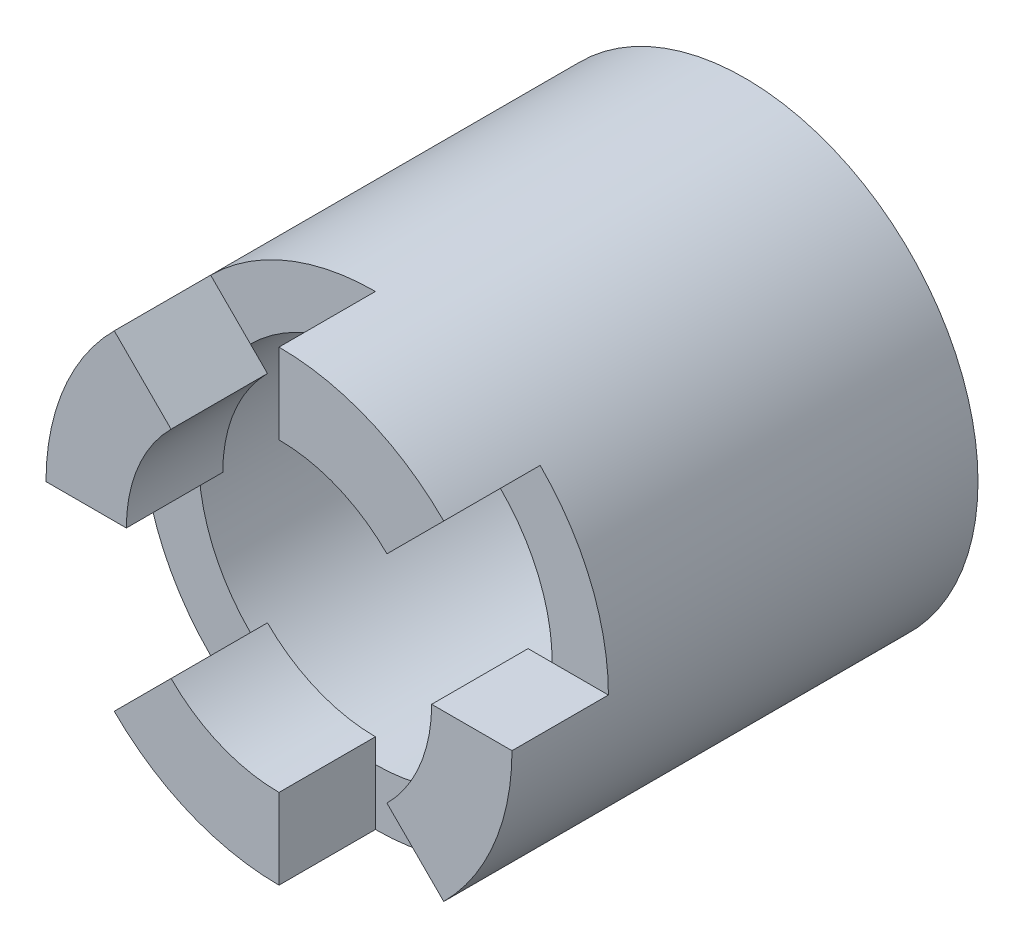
ISO-10303-21;
HEADER;
FILE_DESCRIPTION(('STEP AP214'),'2;1');
FILE_NAME('part.step','',(''),(''),'','','');
FILE_SCHEMA(('AUTOMOTIVE_DESIGN { 1 0 10303 214 1 1 1 1 }'));
ENDSEC;
DATA;
#1=APPLICATION_CONTEXT('core data for automotive mechanical design processes');
#2=APPLICATION_PROTOCOL_DEFINITION('international standard','automotive_design',2000,#1);
#3=PRODUCT_CONTEXT('',#1,'mechanical');
#4=PRODUCT('Part','Part','',(#3));
#5=PRODUCT_RELATED_PRODUCT_CATEGORY('part','',(#4));
#6=PRODUCT_DEFINITION_FORMATION('','',#4);
#7=PRODUCT_DEFINITION_CONTEXT('part definition',#1,'design');
#8=PRODUCT_DEFINITION('design','',#6,#7);
#9=PRODUCT_DEFINITION_SHAPE('','',#8);
#10=(LENGTH_UNIT() NAMED_UNIT(*) SI_UNIT(.MILLI.,.METRE.));
#11=(NAMED_UNIT(*) PLANE_ANGLE_UNIT() SI_UNIT($,.RADIAN.));
#12=(NAMED_UNIT(*) SI_UNIT($,.STERADIAN.) SOLID_ANGLE_UNIT());
#13=UNCERTAINTY_MEASURE_WITH_UNIT(LENGTH_MEASURE(1.E-05),#10,'distance_accuracy_value','');
#14=(GEOMETRIC_REPRESENTATION_CONTEXT(3) GLOBAL_UNCERTAINTY_ASSIGNED_CONTEXT((#13)) GLOBAL_UNIT_ASSIGNED_CONTEXT((#10,
#11,#12)) REPRESENTATION_CONTEXT('',''));
#15=CARTESIAN_POINT('',(0.,0.,0.));
#16=DIRECTION('',(0.,0.,1.));
#17=DIRECTION('',(1.,0.,0.));
#18=AXIS2_PLACEMENT_3D('',#15,#16,#17);
#19=CARTESIAN_POINT('',(0.,0.,11.5));
#20=DIRECTION('',(0.,0.,1.));
#21=DIRECTION('',(1.,0.,0.));
#22=AXIS2_PLACEMENT_3D('',#19,#20,#21);
#23=PLANE('',#22);
#24=CARTESIAN_POINT('',(0.,0.,11.5));
#25=DIRECTION('',(0.,0.,1.));
#26=DIRECTION('',(1.,0.,0.));
#27=AXIS2_PLACEMENT_3D('',#24,#25,#26);
#28=CIRCLE('',#27,5.5);
#29=CARTESIAN_POINT('',(5.5,0.,11.5));
#30=VERTEX_POINT('',#29);
#31=CARTESIAN_POINT('',(3.889087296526,3.88908729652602,11.5));
#32=VERTEX_POINT('',#31);
#33=EDGE_CURVE('E331',#30,#32,#28,.T.);
#34=ORIENTED_EDGE('',*,*,#33,.F.);
#35=DIRECTION('',(-1.,0.,0.));
#36=VECTOR('',#35,1.);
#37=CARTESIAN_POINT('',(4.75,0.,11.5));
#38=LINE('',#37,#36);
#39=CARTESIAN_POINT('',(7.25,0.,11.5));
#40=VERTEX_POINT('',#39);
#41=EDGE_CURVE('E58',#40,#30,#38,.T.);
#42=ORIENTED_EDGE('',*,*,#41,.F.);
#43=CARTESIAN_POINT('',(0.,0.,11.5));
#44=DIRECTION('',(0.,0.,1.));
#45=DIRECTION('',(1.,0.,0.));
#46=AXIS2_PLACEMENT_3D('',#43,#44,#45);
#47=CIRCLE('',#46,7.25);
#48=CARTESIAN_POINT('',(5.12652416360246,5.12652416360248,11.5));
#49=VERTEX_POINT('',#48);
#50=EDGE_CURVE('E205',#40,#49,#47,.T.);
#51=ORIENTED_EDGE('',*,*,#50,.T.);
#52=DIRECTION('',(0.707106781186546,0.707106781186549,0.));
#53=VECTOR('',#52,1.);
#54=CARTESIAN_POINT('',(3.35875721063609,3.35875721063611,11.5));
#55=LINE('',#54,#53);
#56=EDGE_CURVE('E11',#32,#49,#55,.T.);
#57=ORIENTED_EDGE('',*,*,#56,.F.);
#58=EDGE_LOOP('',(#34,#42,#51,#57));
#59=FACE_BOUND('',#58,.T.);
#60=ADVANCED_FACE('F39',(#59),#23,.T.);
#61=CARTESIAN_POINT('',(0.,-7.25,11.5));
#62=VERTEX_POINT('',#61);
#63=CARTESIAN_POINT('',(5.12652416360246,-5.12652416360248,11.5));
#64=VERTEX_POINT('',#63);
#65=EDGE_CURVE('E342',#62,#64,#47,.T.);
#66=ORIENTED_EDGE('',*,*,#65,.T.);
#67=DIRECTION('',(0.707106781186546,-0.707106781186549,0.));
#68=VECTOR('',#67,1.);
#69=CARTESIAN_POINT('',(3.3587572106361,-3.35875721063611,11.5));
#70=LINE('',#69,#68);
#71=CARTESIAN_POINT('',(3.889087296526,-3.88908729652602,11.5));
#72=VERTEX_POINT('',#71);
#73=EDGE_CURVE('E355',#72,#64,#70,.T.);
#74=ORIENTED_EDGE('',*,*,#73,.F.);
#75=CARTESIAN_POINT('',(0.,-5.5,11.5));
#76=VERTEX_POINT('',#75);
#77=EDGE_CURVE('E431',#76,#72,#28,.T.);
#78=ORIENTED_EDGE('',*,*,#77,.F.);
#79=DIRECTION('',(0.,1.,0.));
#80=VECTOR('',#79,1.);
#81=CARTESIAN_POINT('',(0.,-4.75,11.5));
#82=LINE('',#81,#80);
#83=EDGE_CURVE('E269',#62,#76,#82,.T.);
#84=ORIENTED_EDGE('',*,*,#83,.F.);
#85=EDGE_LOOP('',(#66,#74,#78,#84));
#86=FACE_BOUND('',#85,.T.);
#87=ADVANCED_FACE('F353',(#86),#23,.T.);
#88=CARTESIAN_POINT('',(-5.5,0.,11.5));
#89=VERTEX_POINT('',#88);
#90=CARTESIAN_POINT('',(-3.889087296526,-3.88908729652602,11.5));
#91=VERTEX_POINT('',#90);
#92=EDGE_CURVE('E414',#89,#91,#28,.T.);
#93=ORIENTED_EDGE('',*,*,#92,.F.);
#94=DIRECTION('',(1.,0.,0.));
#95=VECTOR('',#94,1.);
#96=CARTESIAN_POINT('',(-7.25,0.,11.5));
#97=LINE('',#96,#95);
#98=CARTESIAN_POINT('',(-7.25,0.,11.5));
#99=VERTEX_POINT('',#98);
#100=EDGE_CURVE('E66',#99,#89,#97,.T.);
#101=ORIENTED_EDGE('',*,*,#100,.F.);
#102=CARTESIAN_POINT('',(-5.12652416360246,-5.12652416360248,11.5));
#103=VERTEX_POINT('',#102);
#104=EDGE_CURVE('E341',#99,#103,#47,.T.);
#105=ORIENTED_EDGE('',*,*,#104,.T.);
#106=DIRECTION('',(-0.707106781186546,-0.707106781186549,0.));
#107=VECTOR('',#106,1.);
#108=CARTESIAN_POINT('',(-5.12652416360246,-5.12652416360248,11.5));
#109=LINE('',#108,#107);
#110=EDGE_CURVE('E275',#91,#103,#109,.T.);
#111=ORIENTED_EDGE('',*,*,#110,.F.);
#112=EDGE_LOOP('',(#93,#101,#105,#111));
#113=FACE_BOUND('',#112,.T.);
#114=ADVANCED_FACE('F400',(#113),#23,.T.);
#115=CARTESIAN_POINT('',(0.,7.25,11.5));
#116=VERTEX_POINT('',#115);
#117=CARTESIAN_POINT('',(-5.12652416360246,5.12652416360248,11.5));
#118=VERTEX_POINT('',#117);
#119=EDGE_CURVE('E49',#116,#118,#47,.T.);
#120=ORIENTED_EDGE('',*,*,#119,.T.);
#121=DIRECTION('',(-0.707106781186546,0.707106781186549,0.));
#122=VECTOR('',#121,1.);
#123=CARTESIAN_POINT('',(-5.12652416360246,5.12652416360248,11.5));
#124=LINE('',#123,#122);
#125=CARTESIAN_POINT('',(-3.88908729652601,3.88908729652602,11.5));
#126=VERTEX_POINT('',#125);
#127=EDGE_CURVE('E235',#126,#118,#124,.T.);
#128=ORIENTED_EDGE('',*,*,#127,.F.);
#129=CARTESIAN_POINT('',(0.,5.5,11.5));
#130=VERTEX_POINT('',#129);
#131=EDGE_CURVE('E338',#130,#126,#28,.T.);
#132=ORIENTED_EDGE('',*,*,#131,.F.);
#133=DIRECTION('',(0.,-1.,0.));
#134=VECTOR('',#133,1.);
#135=CARTESIAN_POINT('',(0.,7.25,11.5));
#136=LINE('',#135,#134);
#137=EDGE_CURVE('E308',#116,#130,#136,.T.);
#138=ORIENTED_EDGE('',*,*,#137,.F.);
#139=EDGE_LOOP('',(#120,#128,#132,#138));
#140=FACE_BOUND('',#139,.T.);
#141=ADVANCED_FACE('F396',(#140),#23,.T.);
#142=CARTESIAN_POINT('',(0.,0.,11.5));
#143=DIRECTION('',(0.,0.,-1.));
#144=DIRECTION('',(-1.,0.,0.));
#145=AXIS2_PLACEMENT_3D('',#142,#143,#144);
#146=CYLINDRICAL_SURFACE('',#145,7.25);
#147=ORIENTED_EDGE('',*,*,#119,.F.);
#148=DIRECTION('',(0.,0.,-1.));
#149=VECTOR('',#148,1.);
#150=CARTESIAN_POINT('',(0.,7.25,14.5));
#151=LINE('',#150,#149);
#152=CARTESIAN_POINT('',(0.,7.25,14.5));
#153=VERTEX_POINT('',#152);
#154=EDGE_CURVE('E327',#153,#116,#151,.T.);
#155=ORIENTED_EDGE('',*,*,#154,.F.);
#156=CARTESIAN_POINT('',(0.,0.,14.5));
#157=DIRECTION('',(0.,0.,1.));
#158=DIRECTION('',(1.,0.,0.));
#159=AXIS2_PLACEMENT_3D('',#156,#157,#158);
#160=CIRCLE('',#159,7.25);
#161=CARTESIAN_POINT('',(5.12652416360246,5.12652416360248,14.5));
#162=VERTEX_POINT('',#161);
#163=EDGE_CURVE('E294',#162,#153,#160,.T.);
#164=ORIENTED_EDGE('',*,*,#163,.F.);
#165=DIRECTION('',(0.,0.,-1.));
#166=VECTOR('',#165,1.);
#167=CARTESIAN_POINT('',(5.12652416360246,5.12652416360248,14.5));
#168=LINE('',#167,#166);
#169=EDGE_CURVE('E307',#162,#49,#168,.T.);
#170=ORIENTED_EDGE('',*,*,#169,.T.);
#171=ORIENTED_EDGE('',*,*,#50,.F.);
#172=DIRECTION('',(0.,0.,-1.));
#173=VECTOR('',#172,1.);
#174=CARTESIAN_POINT('',(7.25,0.,14.5));
#175=LINE('',#174,#173);
#176=CARTESIAN_POINT('',(7.25,0.,14.5));
#177=VERTEX_POINT('',#176);
#178=EDGE_CURVE('E182',#177,#40,#175,.T.);
#179=ORIENTED_EDGE('',*,*,#178,.F.);
#180=CARTESIAN_POINT('',(0.,0.,14.5));
#181=DIRECTION('',(0.,0.,1.));
#182=DIRECTION('',(1.,0.,0.));
#183=AXIS2_PLACEMENT_3D('',#180,#181,#182);
#184=CIRCLE('',#183,7.25);
#185=CARTESIAN_POINT('',(5.12652416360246,-5.12652416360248,14.5));
#186=VERTEX_POINT('',#185);
#187=EDGE_CURVE('E189',#186,#177,#184,.T.);
#188=ORIENTED_EDGE('',*,*,#187,.F.);
#189=DIRECTION('',(0.,0.,-1.));
#190=VECTOR('',#189,1.);
#191=CARTESIAN_POINT('',(5.12652416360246,-5.12652416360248,14.5));
#192=LINE('',#191,#190);
#193=EDGE_CURVE('E359',#186,#64,#192,.T.);
#194=ORIENTED_EDGE('',*,*,#193,.T.);
#195=ORIENTED_EDGE('',*,*,#65,.F.);
#196=DIRECTION('',(0.,0.,-1.));
#197=VECTOR('',#196,1.);
#198=CARTESIAN_POINT('',(0.,-7.25,14.5));
#199=LINE('',#198,#197);
#200=CARTESIAN_POINT('',(0.,-7.25,14.5));
#201=VERTEX_POINT('',#200);
#202=EDGE_CURVE('E290',#201,#62,#199,.T.);
#203=ORIENTED_EDGE('',*,*,#202,.F.);
#204=CARTESIAN_POINT('',(0.,0.,14.5));
#205=DIRECTION('',(0.,0.,1.));
#206=DIRECTION('',(1.,0.,0.));
#207=AXIS2_PLACEMENT_3D('',#204,#205,#206);
#208=CIRCLE('',#207,7.25);
#209=CARTESIAN_POINT('',(-5.12652416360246,-5.12652416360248,14.5));
#210=VERTEX_POINT('',#209);
#211=EDGE_CURVE('E254',#210,#201,#208,.T.);
#212=ORIENTED_EDGE('',*,*,#211,.F.);
#213=DIRECTION('',(0.,0.,-1.));
#214=VECTOR('',#213,1.);
#215=CARTESIAN_POINT('',(-5.12652416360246,-5.12652416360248,14.5));
#216=LINE('',#215,#214);
#217=EDGE_CURVE('E268',#210,#103,#216,.T.);
#218=ORIENTED_EDGE('',*,*,#217,.T.);
#219=ORIENTED_EDGE('',*,*,#104,.F.);
#220=DIRECTION('',(0.,0.,-1.));
#221=VECTOR('',#220,1.);
#222=CARTESIAN_POINT('',(-7.25,0.,14.5));
#223=LINE('',#222,#221);
#224=CARTESIAN_POINT('',(-7.25,0.,14.5));
#225=VERTEX_POINT('',#224);
#226=EDGE_CURVE('E250',#225,#99,#223,.T.);
#227=ORIENTED_EDGE('',*,*,#226,.F.);
#228=CARTESIAN_POINT('',(0.,0.,14.5));
#229=DIRECTION('',(0.,0.,1.));
#230=DIRECTION('',(1.,0.,0.));
#231=AXIS2_PLACEMENT_3D('',#228,#229,#230);
#232=CIRCLE('',#231,7.25);
#233=CARTESIAN_POINT('',(-5.12652416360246,5.12652416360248,14.5));
#234=VERTEX_POINT('',#233);
#235=EDGE_CURVE('E216',#234,#225,#232,.T.);
#236=ORIENTED_EDGE('',*,*,#235,.F.);
#237=DIRECTION('',(0.,0.,-1.));
#238=VECTOR('',#237,1.);
#239=CARTESIAN_POINT('',(-5.12652416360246,5.12652416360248,14.5));
#240=LINE('',#239,#238);
#241=EDGE_CURVE('E229',#234,#118,#240,.T.);
#242=ORIENTED_EDGE('',*,*,#241,.T.);
#243=EDGE_LOOP('',(#147,#155,#164,#170,#171,#179,#188,#194,#195,#203,#212,#218,#219,#227,#236,#242));
#244=FACE_BOUND('',#243,.T.);
#245=CARTESIAN_POINT('',(0.,0.,0.));
#246=DIRECTION('',(0.,0.,1.));
#247=DIRECTION('',(1.,0.,0.));
#248=AXIS2_PLACEMENT_3D('',#245,#246,#247);
#249=CIRCLE('',#248,7.25);
#250=CARTESIAN_POINT('',(7.25,0.,0.));
#251=VERTEX_POINT('',#250);
#252=EDGE_CURVE('E43',#251,#251,#249,.T.);
#253=ORIENTED_EDGE('',*,*,#252,.T.);
#254=EDGE_LOOP('',(#253));
#255=FACE_BOUND('',#254,.T.);
#256=ADVANCED_FACE('F41',(#244,#255),#146,.T.);
#257=CARTESIAN_POINT('',(0.,0.,0.));
#258=DIRECTION('',(0.,0.,1.));
#259=DIRECTION('',(1.,0.,0.));
#260=AXIS2_PLACEMENT_3D('',#257,#258,#259);
#261=PLANE('',#260);
#262=ORIENTED_EDGE('',*,*,#252,.F.);
#263=EDGE_LOOP('',(#262));
#264=FACE_BOUND('',#263,.T.);
#265=ADVANCED_FACE('F408',(#264),#261,.F.);
#266=CARTESIAN_POINT('',(0.,0.,2.5));
#267=DIRECTION('',(0.,0.,1.));
#268=DIRECTION('',(1.,0.,0.));
#269=AXIS2_PLACEMENT_3D('',#266,#267,#268);
#270=CYLINDRICAL_SURFACE('',#269,5.5);
#271=CARTESIAN_POINT('',(0.,0.,2.5));
#272=DIRECTION('',(0.,0.,1.));
#273=DIRECTION('',(1.,0.,0.));
#274=AXIS2_PLACEMENT_3D('',#271,#272,#273);
#275=CIRCLE('',#274,5.5);
#276=CARTESIAN_POINT('',(5.5,0.,2.5));
#277=VERTEX_POINT('',#276);
#278=EDGE_CURVE('E332',#277,#277,#275,.T.);
#279=ORIENTED_EDGE('',*,*,#278,.F.);
#280=EDGE_LOOP('',(#279));
#281=FACE_BOUND('',#280,.T.);
#282=EDGE_CURVE('E336',#32,#130,#28,.T.);
#283=ORIENTED_EDGE('',*,*,#282,.T.);
#284=ORIENTED_EDGE('',*,*,#131,.T.);
#285=EDGE_CURVE('E422',#126,#89,#28,.T.);
#286=ORIENTED_EDGE('',*,*,#285,.T.);
#287=ORIENTED_EDGE('',*,*,#92,.T.);
#288=EDGE_CURVE('E423',#91,#76,#28,.T.);
#289=ORIENTED_EDGE('',*,*,#288,.T.);
#290=ORIENTED_EDGE('',*,*,#77,.T.);
#291=EDGE_CURVE('E424',#72,#30,#28,.T.);
#292=ORIENTED_EDGE('',*,*,#291,.T.);
#293=ORIENTED_EDGE('',*,*,#33,.T.);
#294=EDGE_LOOP('',(#283,#284,#286,#287,#289,#290,#292,#293));
#295=FACE_BOUND('',#294,.T.);
#296=ADVANCED_FACE('F426',(#281,#295),#270,.F.);
#297=CARTESIAN_POINT('',(0.,0.,2.5));
#298=DIRECTION('',(0.,0.,1.));
#299=DIRECTION('',(1.,0.,0.));
#300=AXIS2_PLACEMENT_3D('',#297,#298,#299);
#301=PLANE('',#300);
#302=ORIENTED_EDGE('',*,*,#278,.T.);
#303=EDGE_LOOP('',(#302));
#304=FACE_BOUND('',#303,.T.);
#305=ADVANCED_FACE('F519',(#304),#301,.T.);
#306=CARTESIAN_POINT('',(0.,7.25,14.5));
#307=DIRECTION('',(1.,0.,0.));
#308=DIRECTION('',(0.,0.,-1.));
#309=AXIS2_PLACEMENT_3D('',#306,#307,#308);
#310=PLANE('',#309);
#311=ORIENTED_EDGE('',*,*,#137,.T.);
#312=CARTESIAN_POINT('',(0.,4.75,11.5));
#313=VERTEX_POINT('',#312);
#314=EDGE_CURVE('E293',#130,#313,#136,.T.);
#315=ORIENTED_EDGE('',*,*,#314,.T.);
#316=DIRECTION('',(0.,0.,-1.));
#317=VECTOR('',#316,1.);
#318=CARTESIAN_POINT('',(0.,4.75,14.5));
#319=LINE('',#318,#317);
#320=CARTESIAN_POINT('',(0.,4.75,14.5));
#321=VERTEX_POINT('',#320);
#322=EDGE_CURVE('E323',#321,#313,#319,.T.);
#323=ORIENTED_EDGE('',*,*,#322,.F.);
#324=DIRECTION('',(0.,-1.,0.));
#325=VECTOR('',#324,1.);
#326=CARTESIAN_POINT('',(0.,7.25,14.5));
#327=LINE('',#326,#325);
#328=EDGE_CURVE('E298',#153,#321,#327,.T.);
#329=ORIENTED_EDGE('',*,*,#328,.F.);
#330=ORIENTED_EDGE('',*,*,#154,.T.);
#331=EDGE_LOOP('',(#311,#315,#323,#329,#330));
#332=FACE_BOUND('',#331,.T.);
#333=ADVANCED_FACE('F455',(#332),#310,.F.);
#334=CARTESIAN_POINT('',(0.,0.,14.5));
#335=DIRECTION('',(0.,0.,-1.));
#336=DIRECTION('',(-1.,0.,0.));
#337=AXIS2_PLACEMENT_3D('',#334,#335,#336);
#338=CYLINDRICAL_SURFACE('',#337,4.75);
#339=CARTESIAN_POINT('',(0.,0.,11.5));
#340=DIRECTION('',(0.,0.,-1.));
#341=DIRECTION('',(1.,0.,0.));
#342=AXIS2_PLACEMENT_3D('',#339,#340,#341);
#343=CIRCLE('',#342,4.75);
#344=CARTESIAN_POINT('',(3.35875721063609,3.35875721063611,11.5));
#345=VERTEX_POINT('',#344);
#346=EDGE_CURVE('E312',#313,#345,#343,.T.);
#347=ORIENTED_EDGE('',*,*,#346,.T.);
#348=DIRECTION('',(0.,0.,-1.));
#349=VECTOR('',#348,1.);
#350=CARTESIAN_POINT('',(3.35875721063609,3.35875721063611,14.5));
#351=LINE('',#350,#349);
#352=CARTESIAN_POINT('',(3.35875721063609,3.35875721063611,14.5));
#353=VERTEX_POINT('',#352);
#354=EDGE_CURVE('E319',#353,#345,#351,.T.);
#355=ORIENTED_EDGE('',*,*,#354,.F.);
#356=CARTESIAN_POINT('',(0.,0.,14.5));
#357=DIRECTION('',(0.,0.,-1.));
#358=DIRECTION('',(1.,0.,0.));
#359=AXIS2_PLACEMENT_3D('',#356,#357,#358);
#360=CIRCLE('',#359,4.75);
#361=EDGE_CURVE('E301',#321,#353,#360,.T.);
#362=ORIENTED_EDGE('',*,*,#361,.F.);
#363=ORIENTED_EDGE('',*,*,#322,.T.);
#364=EDGE_LOOP('',(#347,#355,#362,#363));
#365=FACE_BOUND('',#364,.T.);
#366=ADVANCED_FACE('F452',(#365),#338,.F.);
#367=CARTESIAN_POINT('',(3.35875721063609,3.35875721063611,14.5));
#368=DIRECTION('',(-0.707106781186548,0.707106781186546,0.));
#369=DIRECTION('',(-0.707106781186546,-0.707106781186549,0.));
#370=AXIS2_PLACEMENT_3D('',#367,#368,#369);
#371=PLANE('',#370);
#372=EDGE_CURVE('E51',#345,#32,#55,.T.);
#373=ORIENTED_EDGE('',*,*,#372,.T.);
#374=ORIENTED_EDGE('',*,*,#56,.T.);
#375=ORIENTED_EDGE('',*,*,#169,.F.);
#376=DIRECTION('',(0.707106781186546,0.707106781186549,0.));
#377=VECTOR('',#376,1.);
#378=CARTESIAN_POINT('',(3.35875721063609,3.35875721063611,14.5));
#379=LINE('',#378,#377);
#380=EDGE_CURVE('E304',#353,#162,#379,.T.);
#381=ORIENTED_EDGE('',*,*,#380,.F.);
#382=ORIENTED_EDGE('',*,*,#354,.T.);
#383=EDGE_LOOP('',(#373,#374,#375,#381,#382));
#384=FACE_BOUND('',#383,.T.);
#385=ADVANCED_FACE('F447',(#384),#371,.F.);
#386=CARTESIAN_POINT('',(0.,0.,14.5));
#387=DIRECTION('',(0.,0.,1.));
#388=DIRECTION('',(1.,0.,0.));
#389=AXIS2_PLACEMENT_3D('',#386,#387,#388);
#390=PLANE('',#389);
#391=ORIENTED_EDGE('',*,*,#163,.T.);
#392=ORIENTED_EDGE('',*,*,#328,.T.);
#393=ORIENTED_EDGE('',*,*,#361,.T.);
#394=ORIENTED_EDGE('',*,*,#380,.T.);
#395=EDGE_LOOP('',(#391,#392,#393,#394));
#396=FACE_BOUND('',#395,.T.);
#397=ADVANCED_FACE('F507',(#396),#390,.T.);
#398=CARTESIAN_POINT('',(0.,0.,11.5));
#399=DIRECTION('',(0.,0.,1.));
#400=DIRECTION('',(1.,0.,0.));
#401=AXIS2_PLACEMENT_3D('',#398,#399,#400);
#402=PLANE('',#401);
#403=ORIENTED_EDGE('',*,*,#282,.F.);
#404=ORIENTED_EDGE('',*,*,#372,.F.);
#405=ORIENTED_EDGE('',*,*,#346,.F.);
#406=ORIENTED_EDGE('',*,*,#314,.F.);
#407=EDGE_LOOP('',(#403,#404,#405,#406));
#408=FACE_BOUND('',#407,.T.);
#409=ADVANCED_FACE('F445',(#408),#402,.F.);
#410=CARTESIAN_POINT('',(0.,0.,11.5));
#411=DIRECTION('',(0.,0.,1.));
#412=DIRECTION('',(1.,0.,0.));
#413=AXIS2_PLACEMENT_3D('',#410,#411,#412);
#414=PLANE('',#413);
#415=CARTESIAN_POINT('',(0.,-4.75,11.5));
#416=VERTEX_POINT('',#415);
#417=EDGE_CURVE('E253',#76,#416,#82,.T.);
#418=ORIENTED_EDGE('',*,*,#417,.F.);
#419=ORIENTED_EDGE('',*,*,#288,.F.);
#420=CARTESIAN_POINT('',(-3.3587572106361,-3.35875721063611,11.5));
#421=VERTEX_POINT('',#420);
#422=EDGE_CURVE('E259',#421,#91,#109,.T.);
#423=ORIENTED_EDGE('',*,*,#422,.F.);
#424=CARTESIAN_POINT('',(0.,0.,11.5));
#425=DIRECTION('',(0.,0.,-1.));
#426=DIRECTION('',(1.,0.,0.));
#427=AXIS2_PLACEMENT_3D('',#424,#425,#426);
#428=CIRCLE('',#427,4.75);
#429=EDGE_CURVE('E272',#416,#421,#428,.T.);
#430=ORIENTED_EDGE('',*,*,#429,.F.);
#431=EDGE_LOOP('',(#418,#419,#423,#430));
#432=FACE_BOUND('',#431,.T.);
#433=ADVANCED_FACE('F492',(#432),#414,.F.);
#434=CARTESIAN_POINT('',(0.,-4.75,14.5));
#435=DIRECTION('',(-1.,0.,0.));
#436=DIRECTION('',(0.,0.,1.));
#437=AXIS2_PLACEMENT_3D('',#434,#435,#436);
#438=PLANE('',#437);
#439=ORIENTED_EDGE('',*,*,#83,.T.);
#440=ORIENTED_EDGE('',*,*,#417,.T.);
#441=DIRECTION('',(0.,0.,-1.));
#442=VECTOR('',#441,1.);
#443=CARTESIAN_POINT('',(0.,-4.75,14.5));
#444=LINE('',#443,#442);
#445=CARTESIAN_POINT('',(0.,-4.75,14.5));
#446=VERTEX_POINT('',#445);
#447=EDGE_CURVE('E286',#446,#416,#444,.T.);
#448=ORIENTED_EDGE('',*,*,#447,.F.);
#449=DIRECTION('',(0.,1.,0.));
#450=VECTOR('',#449,1.);
#451=CARTESIAN_POINT('',(0.,-4.75,14.5));
#452=LINE('',#451,#450);
#453=EDGE_CURVE('E258',#201,#446,#452,.T.);
#454=ORIENTED_EDGE('',*,*,#453,.F.);
#455=ORIENTED_EDGE('',*,*,#202,.T.);
#456=EDGE_LOOP('',(#439,#440,#448,#454,#455));
#457=FACE_BOUND('',#456,.T.);
#458=ADVANCED_FACE('F495',(#457),#438,.F.);
#459=CARTESIAN_POINT('',(0.,0.,14.5));
#460=DIRECTION('',(0.,0.,-1.));
#461=DIRECTION('',(-1.,0.,0.));
#462=AXIS2_PLACEMENT_3D('',#459,#460,#461);
#463=CYLINDRICAL_SURFACE('',#462,4.75);
#464=ORIENTED_EDGE('',*,*,#429,.T.);
#465=DIRECTION('',(0.,0.,-1.));
#466=VECTOR('',#465,1.);
#467=CARTESIAN_POINT('',(-3.3587572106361,-3.35875721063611,14.5));
#468=LINE('',#467,#466);
#469=CARTESIAN_POINT('',(-3.3587572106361,-3.35875721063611,14.5));
#470=VERTEX_POINT('',#469);
#471=EDGE_CURVE('E282',#470,#421,#468,.T.);
#472=ORIENTED_EDGE('',*,*,#471,.F.);
#473=CARTESIAN_POINT('',(0.,0.,14.5));
#474=DIRECTION('',(0.,0.,-1.));
#475=DIRECTION('',(1.,0.,0.));
#476=AXIS2_PLACEMENT_3D('',#473,#474,#475);
#477=CIRCLE('',#476,4.75);
#478=EDGE_CURVE('E262',#446,#470,#477,.T.);
#479=ORIENTED_EDGE('',*,*,#478,.F.);
#480=ORIENTED_EDGE('',*,*,#447,.T.);
#481=EDGE_LOOP('',(#464,#472,#479,#480));
#482=FACE_BOUND('',#481,.T.);
#483=ADVANCED_FACE('F499',(#482),#463,.F.);
#484=CARTESIAN_POINT('',(-5.12652416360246,-5.12652416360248,14.5));
#485=DIRECTION('',(0.707106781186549,-0.707106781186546,0.));
#486=DIRECTION('',(0.707106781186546,0.707106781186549,0.));
#487=AXIS2_PLACEMENT_3D('',#484,#485,#486);
#488=PLANE('',#487);
#489=ORIENTED_EDGE('',*,*,#422,.T.);
#490=ORIENTED_EDGE('',*,*,#110,.T.);
#491=ORIENTED_EDGE('',*,*,#217,.F.);
#492=DIRECTION('',(-0.707106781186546,-0.707106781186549,0.));
#493=VECTOR('',#492,1.);
#494=CARTESIAN_POINT('',(-5.12652416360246,-5.12652416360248,14.5));
#495=LINE('',#494,#493);
#496=EDGE_CURVE('E265',#470,#210,#495,.T.);
#497=ORIENTED_EDGE('',*,*,#496,.F.);
#498=ORIENTED_EDGE('',*,*,#471,.T.);
#499=EDGE_LOOP('',(#489,#490,#491,#497,#498));
#500=FACE_BOUND('',#499,.T.);
#501=ADVANCED_FACE('F490',(#500),#488,.F.);
#502=CARTESIAN_POINT('',(0.,0.,14.5));
#503=DIRECTION('',(0.,0.,1.));
#504=DIRECTION('',(1.,0.,0.));
#505=AXIS2_PLACEMENT_3D('',#502,#503,#504);
#506=PLANE('',#505);
#507=ORIENTED_EDGE('',*,*,#211,.T.);
#508=ORIENTED_EDGE('',*,*,#453,.T.);
#509=ORIENTED_EDGE('',*,*,#478,.T.);
#510=ORIENTED_EDGE('',*,*,#496,.T.);
#511=EDGE_LOOP('',(#507,#508,#509,#510));
#512=FACE_BOUND('',#511,.T.);
#513=ADVANCED_FACE('F484',(#512),#506,.T.);
#514=CARTESIAN_POINT('',(0.,0.,11.5));
#515=DIRECTION('',(0.,0.,1.));
#516=DIRECTION('',(1.,0.,0.));
#517=AXIS2_PLACEMENT_3D('',#514,#515,#516);
#518=PLANE('',#517);
#519=CARTESIAN_POINT('',(-4.75,0.,11.5));
#520=VERTEX_POINT('',#519);
#521=EDGE_CURVE('E207',#89,#520,#97,.T.);
#522=ORIENTED_EDGE('',*,*,#521,.F.);
#523=ORIENTED_EDGE('',*,*,#285,.F.);
#524=CARTESIAN_POINT('',(-3.3587572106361,3.35875721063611,11.5));
#525=VERTEX_POINT('',#524);
#526=EDGE_CURVE('E221',#525,#126,#124,.T.);
#527=ORIENTED_EDGE('',*,*,#526,.F.);
#528=CARTESIAN_POINT('',(0.,0.,11.5));
#529=DIRECTION('',(0.,0.,-1.));
#530=DIRECTION('',(1.,0.,0.));
#531=AXIS2_PLACEMENT_3D('',#528,#529,#530);
#532=CIRCLE('',#531,4.75);
#533=EDGE_CURVE('E232',#520,#525,#532,.T.);
#534=ORIENTED_EDGE('',*,*,#533,.F.);
#535=EDGE_LOOP('',(#522,#523,#527,#534));
#536=FACE_BOUND('',#535,.T.);
#537=ADVANCED_FACE('F474',(#536),#518,.F.);
#538=CARTESIAN_POINT('',(-7.25,0.,14.5));
#539=DIRECTION('',(0.,1.,0.));
#540=DIRECTION('',(0.,0.,1.));
#541=AXIS2_PLACEMENT_3D('',#538,#539,#540);
#542=PLANE('',#541);
#543=ORIENTED_EDGE('',*,*,#100,.T.);
#544=ORIENTED_EDGE('',*,*,#521,.T.);
#545=DIRECTION('',(0.,0.,-1.));
#546=VECTOR('',#545,1.);
#547=CARTESIAN_POINT('',(-4.75,0.,14.5));
#548=LINE('',#547,#546);
#549=CARTESIAN_POINT('',(-4.75,0.,14.5));
#550=VERTEX_POINT('',#549);
#551=EDGE_CURVE('E246',#550,#520,#548,.T.);
#552=ORIENTED_EDGE('',*,*,#551,.F.);
#553=DIRECTION('',(1.,0.,0.));
#554=VECTOR('',#553,1.);
#555=CARTESIAN_POINT('',(-7.25,0.,14.5));
#556=LINE('',#555,#554);
#557=EDGE_CURVE('E220',#225,#550,#556,.T.);
#558=ORIENTED_EDGE('',*,*,#557,.F.);
#559=ORIENTED_EDGE('',*,*,#226,.T.);
#560=EDGE_LOOP('',(#543,#544,#552,#558,#559));
#561=FACE_BOUND('',#560,.T.);
#562=ADVANCED_FACE('F476',(#561),#542,.F.);
#563=CARTESIAN_POINT('',(0.,0.,14.5));
#564=DIRECTION('',(0.,0.,-1.));
#565=DIRECTION('',(-1.,0.,0.));
#566=AXIS2_PLACEMENT_3D('',#563,#564,#565);
#567=CYLINDRICAL_SURFACE('',#566,4.75);
#568=ORIENTED_EDGE('',*,*,#533,.T.);
#569=DIRECTION('',(0.,0.,-1.));
#570=VECTOR('',#569,1.);
#571=CARTESIAN_POINT('',(-3.3587572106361,3.35875721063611,14.5));
#572=LINE('',#571,#570);
#573=CARTESIAN_POINT('',(-3.3587572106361,3.35875721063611,14.5));
#574=VERTEX_POINT('',#573);
#575=EDGE_CURVE('E242',#574,#525,#572,.T.);
#576=ORIENTED_EDGE('',*,*,#575,.F.);
#577=CARTESIAN_POINT('',(0.,0.,14.5));
#578=DIRECTION('',(0.,0.,-1.));
#579=DIRECTION('',(1.,0.,0.));
#580=AXIS2_PLACEMENT_3D('',#577,#578,#579);
#581=CIRCLE('',#580,4.75);
#582=EDGE_CURVE('E224',#550,#574,#581,.T.);
#583=ORIENTED_EDGE('',*,*,#582,.F.);
#584=ORIENTED_EDGE('',*,*,#551,.T.);
#585=EDGE_LOOP('',(#568,#576,#583,#584));
#586=FACE_BOUND('',#585,.T.);
#587=ADVANCED_FACE('F475',(#586),#567,.F.);
#588=CARTESIAN_POINT('',(-5.12652416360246,5.12652416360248,14.5));
#589=DIRECTION('',(-0.707106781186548,-0.707106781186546,0.));
#590=DIRECTION('',(0.707106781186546,-0.707106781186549,0.));
#591=AXIS2_PLACEMENT_3D('',#588,#589,#590);
#592=PLANE('',#591);
#593=ORIENTED_EDGE('',*,*,#526,.T.);
#594=ORIENTED_EDGE('',*,*,#127,.T.);
#595=ORIENTED_EDGE('',*,*,#241,.F.);
#596=DIRECTION('',(-0.707106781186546,0.707106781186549,0.));
#597=VECTOR('',#596,1.);
#598=CARTESIAN_POINT('',(-5.12652416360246,5.12652416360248,14.5));
#599=LINE('',#598,#597);
#600=EDGE_CURVE('E227',#574,#234,#599,.T.);
#601=ORIENTED_EDGE('',*,*,#600,.F.);
#602=ORIENTED_EDGE('',*,*,#575,.T.);
#603=EDGE_LOOP('',(#593,#594,#595,#601,#602));
#604=FACE_BOUND('',#603,.T.);
#605=ADVANCED_FACE('F462',(#604),#592,.F.);
#606=CARTESIAN_POINT('',(0.,0.,14.5));
#607=DIRECTION('',(0.,0.,1.));
#608=DIRECTION('',(1.,0.,0.));
#609=AXIS2_PLACEMENT_3D('',#606,#607,#608);
#610=PLANE('',#609);
#611=ORIENTED_EDGE('',*,*,#235,.T.);
#612=ORIENTED_EDGE('',*,*,#557,.T.);
#613=ORIENTED_EDGE('',*,*,#582,.T.);
#614=ORIENTED_EDGE('',*,*,#600,.T.);
#615=EDGE_LOOP('',(#611,#612,#613,#614));
#616=FACE_BOUND('',#615,.T.);
#617=ADVANCED_FACE('F468',(#616),#610,.T.);
#618=CARTESIAN_POINT('',(0.,0.,11.5));
#619=DIRECTION('',(0.,0.,1.));
#620=DIRECTION('',(1.,0.,0.));
#621=AXIS2_PLACEMENT_3D('',#618,#619,#620);
#622=PLANE('',#621);
#623=CARTESIAN_POINT('',(4.75,0.,11.5));
#624=VERTEX_POINT('',#623);
#625=EDGE_CURVE('E375',#30,#624,#38,.T.);
#626=ORIENTED_EDGE('',*,*,#625,.F.);
#627=ORIENTED_EDGE('',*,*,#291,.F.);
#628=CARTESIAN_POINT('',(3.35875721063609,-3.35875721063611,11.5));
#629=VERTEX_POINT('',#628);
#630=EDGE_CURVE('E199',#629,#72,#70,.T.);
#631=ORIENTED_EDGE('',*,*,#630,.F.);
#632=CARTESIAN_POINT('',(0.,0.,11.5));
#633=DIRECTION('',(0.,0.,-1.));
#634=DIRECTION('',(1.,0.,0.));
#635=AXIS2_PLACEMENT_3D('',#632,#633,#634);
#636=CIRCLE('',#635,4.75);
#637=EDGE_CURVE('E371',#624,#629,#636,.T.);
#638=ORIENTED_EDGE('',*,*,#637,.F.);
#639=EDGE_LOOP('',(#626,#627,#631,#638));
#640=FACE_BOUND('',#639,.T.);
#641=ADVANCED_FACE('F639',(#640),#622,.F.);
#642=CARTESIAN_POINT('',(4.75,0.,14.5));
#643=DIRECTION('',(0.,-1.,0.));
#644=DIRECTION('',(0.,0.,-1.));
#645=AXIS2_PLACEMENT_3D('',#642,#643,#644);
#646=PLANE('',#645);
#647=ORIENTED_EDGE('',*,*,#41,.T.);
#648=ORIENTED_EDGE('',*,*,#625,.T.);
#649=DIRECTION('',(0.,0.,-1.));
#650=VECTOR('',#649,1.);
#651=CARTESIAN_POINT('',(4.75,0.,14.5));
#652=LINE('',#651,#650);
#653=CARTESIAN_POINT('',(4.75,0.,14.5));
#654=VERTEX_POINT('',#653);
#655=EDGE_CURVE('E184',#654,#624,#652,.T.);
#656=ORIENTED_EDGE('',*,*,#655,.F.);
#657=DIRECTION('',(-1.,0.,0.));
#658=VECTOR('',#657,1.);
#659=CARTESIAN_POINT('',(4.75,0.,14.5));
#660=LINE('',#659,#658);
#661=EDGE_CURVE('E178',#177,#654,#660,.T.);
#662=ORIENTED_EDGE('',*,*,#661,.F.);
#663=ORIENTED_EDGE('',*,*,#178,.T.);
#664=EDGE_LOOP('',(#647,#648,#656,#662,#663));
#665=FACE_BOUND('',#664,.T.);
#666=ADVANCED_FACE('F180',(#665),#646,.F.);
#667=CARTESIAN_POINT('',(0.,0.,14.5));
#668=DIRECTION('',(0.,0.,-1.));
#669=DIRECTION('',(-1.,0.,0.));
#670=AXIS2_PLACEMENT_3D('',#667,#668,#669);
#671=CYLINDRICAL_SURFACE('',#670,4.75);
#672=ORIENTED_EDGE('',*,*,#637,.T.);
#673=DIRECTION('',(0.,0.,-1.));
#674=VECTOR('',#673,1.);
#675=CARTESIAN_POINT('',(3.35875721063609,-3.35875721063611,14.5));
#676=LINE('',#675,#674);
#677=CARTESIAN_POINT('',(3.35875721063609,-3.35875721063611,14.5));
#678=VERTEX_POINT('',#677);
#679=EDGE_CURVE('E212',#678,#629,#676,.T.);
#680=ORIENTED_EDGE('',*,*,#679,.F.);
#681=CARTESIAN_POINT('',(0.,0.,14.5));
#682=DIRECTION('',(0.,0.,-1.));
#683=DIRECTION('',(1.,0.,0.));
#684=AXIS2_PLACEMENT_3D('',#681,#682,#683);
#685=CIRCLE('',#684,4.75);
#686=EDGE_CURVE('E188',#654,#678,#685,.T.);
#687=ORIENTED_EDGE('',*,*,#686,.F.);
#688=ORIENTED_EDGE('',*,*,#655,.T.);
#689=EDGE_LOOP('',(#672,#680,#687,#688));
#690=FACE_BOUND('',#689,.T.);
#691=ADVANCED_FACE('F380',(#690),#671,.F.);
#692=CARTESIAN_POINT('',(3.3587572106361,-3.35875721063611,14.5));
#693=DIRECTION('',(0.707106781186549,0.707106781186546,0.));
#694=DIRECTION('',(-0.707106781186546,0.707106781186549,0.));
#695=AXIS2_PLACEMENT_3D('',#692,#693,#694);
#696=PLANE('',#695);
#697=ORIENTED_EDGE('',*,*,#630,.T.);
#698=ORIENTED_EDGE('',*,*,#73,.T.);
#699=ORIENTED_EDGE('',*,*,#193,.F.);
#700=DIRECTION('',(0.707106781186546,-0.707106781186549,0.));
#701=VECTOR('',#700,1.);
#702=CARTESIAN_POINT('',(3.3587572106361,-3.35875721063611,14.5));
#703=LINE('',#702,#701);
#704=EDGE_CURVE('E194',#678,#186,#703,.T.);
#705=ORIENTED_EDGE('',*,*,#704,.F.);
#706=ORIENTED_EDGE('',*,*,#679,.T.);
#707=EDGE_LOOP('',(#697,#698,#699,#705,#706));
#708=FACE_BOUND('',#707,.T.);
#709=ADVANCED_FACE('F383',(#708),#696,.F.);
#710=CARTESIAN_POINT('',(0.,0.,14.5));
#711=DIRECTION('',(0.,0.,1.));
#712=DIRECTION('',(1.,0.,0.));
#713=AXIS2_PLACEMENT_3D('',#710,#711,#712);
#714=PLANE('',#713);
#715=ORIENTED_EDGE('',*,*,#187,.T.);
#716=ORIENTED_EDGE('',*,*,#661,.T.);
#717=ORIENTED_EDGE('',*,*,#686,.T.);
#718=ORIENTED_EDGE('',*,*,#704,.T.);
#719=EDGE_LOOP('',(#715,#716,#717,#718));
#720=FACE_BOUND('',#719,.T.);
#721=ADVANCED_FACE('F192',(#720),#714,.T.);
#722=CLOSED_SHELL('',(#60,#87,#114,#141,#256,#265,#296,#305,#333,#366,#385,#397,#409,#433,#458,
#483,#501,#513,#537,#562,#587,#605,#617,#641,#666,#691,#709,#721));
#723=MANIFOLD_SOLID_BREP('B2',#722);
#724=ADVANCED_BREP_SHAPE_REPRESENTATION('',(#18,#723),#14);
#725=SHAPE_DEFINITION_REPRESENTATION(#9,#724);
ENDSEC;
END-ISO-10303-21;
